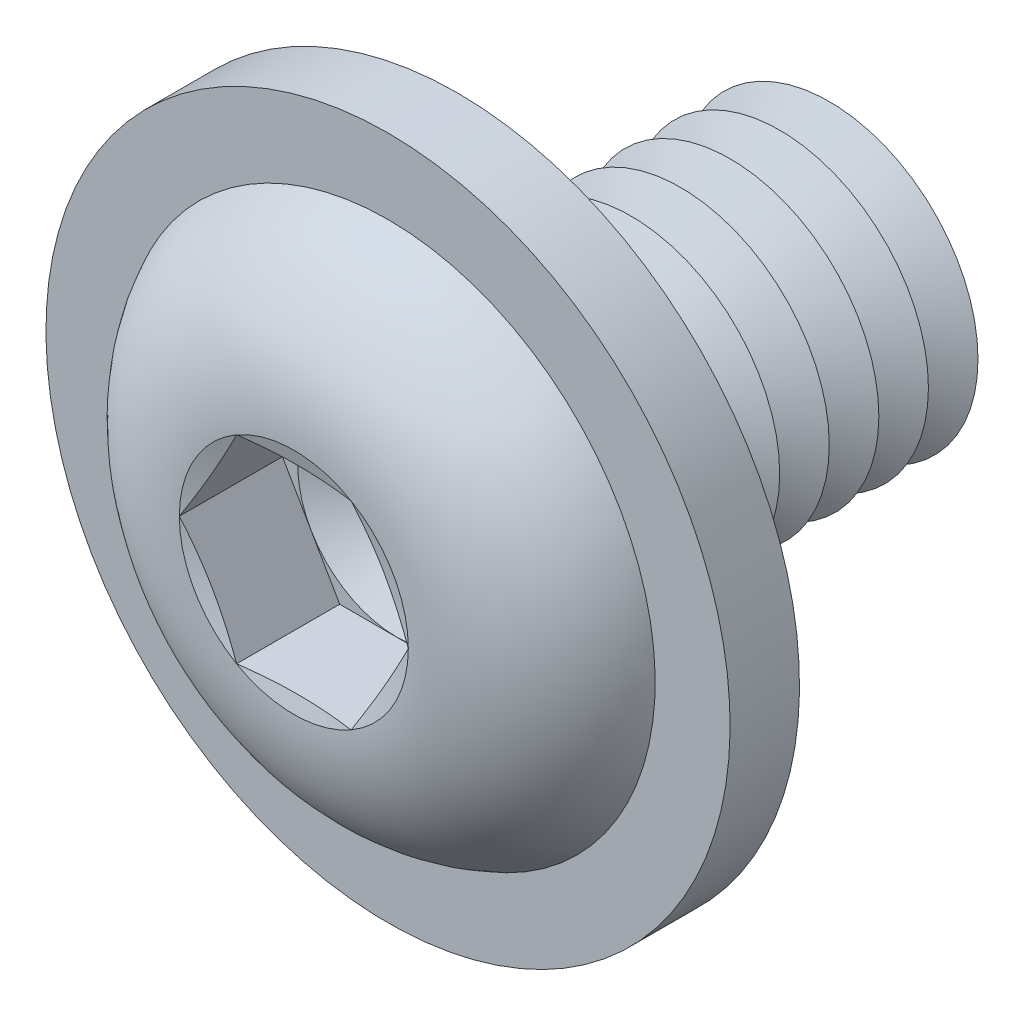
from build123d import *

# Parameters (mm, degrees)
FILLET1_R           = 0.25
LPATTERN1_COUNT     = 8
LPATTERN1_PITCH     = 0.5
CUT_EXTRUDE1_DEPTH  = 1.04
SKETCH5_R           = 3.45
SKETCH5_R_2         = 1.75
BOSS_EXTRUDE1_DEPTH = 0.7


with BuildPart() as part:
    # Sketch1 → Revolve1 (revolve)
    with BuildSketch(Plane(origin=(0, 0, 0), x_dir=(0, 0, -1), z_dir=(1, 0, 0)), mode=Mode.PRIVATE) as revolve1_sk:
        with BuildLine():
            Line((0, 1.5), (0, 2.85))
            ThreePointArc((0, 2.85), (-1.182850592, 2.35063849), (-1.65, 1.1547))
            Line((-1.65, 1.1547), (-1.495299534, 0.57735))
            Line((-1.495299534, 0.57735), (-1.65, 0.57735))
            Line((-1.65, 0.57735), (-1.65, 0))
            Line((-1.65, 0), (4, 0))
            Line((4, 0), (4, 1.5))
            Line((4, 1.5), (0, 1.5))
        make_face()
    revolve(revolve1_sk.sketch.rotate(Axis((0, 0, -4), (0, 0, 1)), 90), axis=Axis((0, 0, -4), (0, 0, 1)))

    # Fillet1
    fillet1_edges = [part.edges().sort_by_distance(p)[0] for p in [
        (1.5, 0, 0),
    ]]
    fillet(fillet1_edges, radius=FILLET1_R)

    # Sketch2 → Cut-Revolve1 (revolve, cut)
    with BuildSketch(Plane(origin=(0, 0, 0), x_dir=(0, 0, -1), z_dir=(1, 0, 0)), mode=Mode.PRIVATE) as cut_revolve1_sk:
        Polygon((3.75, 1.5), (4.25, 1.5), (4, 1.066987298), align=None)
    cut_revolve1 = revolve(cut_revolve1_sk.sketch.rotate(Axis((0, 0, -4), (0, 0, -1)), 270), axis=Axis((0, 0, -4), (0, 0, -1)), mode=Mode.SUBTRACT)

    # LPattern1: Cut-Revolve1 ×8
    with Locations(*[(0, 0, i * LPATTERN1_PITCH) for i in range(1, LPATTERN1_COUNT)]):
        add(cut_revolve1, mode=Mode.SUBTRACT)

    # Sketch3 → Cut-Extrude1 (cut)
    with BuildSketch(Plane.XY.offset(1.65)):
        Polygon((0.57735, 0.999999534), (-0.57735, 0.999999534), (-1.1547, 0), (-0.57735, -0.999999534), (0.57735, -0.999999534), (1.1547, 0), align=None)
    extrude(amount=-CUT_EXTRUDE1_DEPTH, mode=Mode.SUBTRACT)

    # Cut-Extrude2 cone 1 section (on through the dimple's axis) → Cut-Extrude2 (revolve, cut)
    with BuildSketch(Plane(origin=(0, 0, 0.61), x_dir=(0, -1, 0), z_dir=(1, 0, 0))):
        Polygon((0, 0), (0.999999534, 0), (0, 0.57735), align=None)
    revolve(axis=Axis((0, 0, 0.61), (0, 0, -1)), mode=Mode.SUBTRACT)

    # Sketch5 → Boss-Extrude1 (add)
    with BuildSketch(Plane(origin=(0, 0, 0), x_dir=(-1, 0, 0), z_dir=(0, 0, -1))):
        with Locations(Location((0, 0, 0), (0, 0, 90))):
            Circle(SKETCH5_R)
        Circle(SKETCH5_R_2, mode=Mode.SUBTRACT)
    extrude(amount=-BOSS_EXTRUDE1_DEPTH)


solid = part.part
